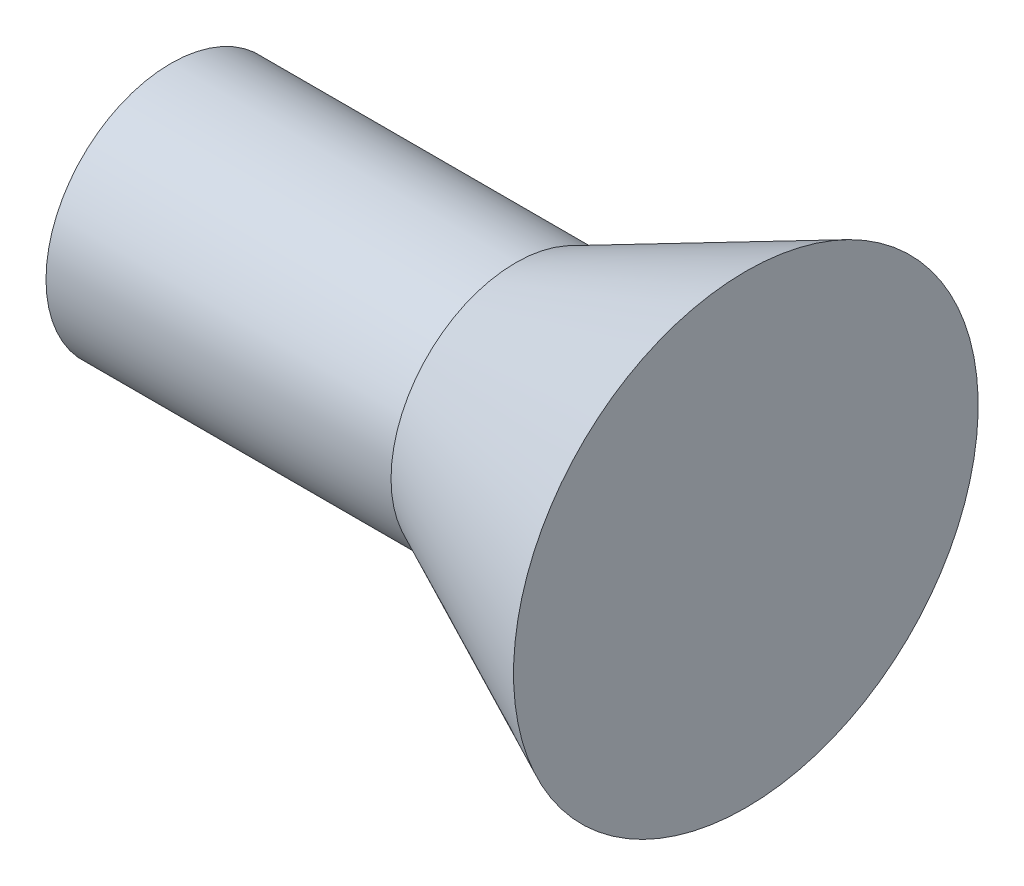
ISO-10303-21;
HEADER;
FILE_DESCRIPTION(('STEP AP214'),'2;1');
FILE_NAME('part.step','',(''),(''),'','','');
FILE_SCHEMA(('AUTOMOTIVE_DESIGN { 1 0 10303 214 1 1 1 1 }'));
ENDSEC;
DATA;
#1=APPLICATION_CONTEXT('core data for automotive mechanical design processes');
#2=APPLICATION_PROTOCOL_DEFINITION('international standard','automotive_design',2000,#1);
#3=PRODUCT_CONTEXT('',#1,'mechanical');
#4=PRODUCT('Part','Part','',(#3));
#5=PRODUCT_RELATED_PRODUCT_CATEGORY('part','',(#4));
#6=PRODUCT_DEFINITION_FORMATION('','',#4);
#7=PRODUCT_DEFINITION_CONTEXT('part definition',#1,'design');
#8=PRODUCT_DEFINITION('design','',#6,#7);
#9=PRODUCT_DEFINITION_SHAPE('','',#8);
#10=(LENGTH_UNIT() NAMED_UNIT(*) SI_UNIT(.MILLI.,.METRE.));
#11=(NAMED_UNIT(*) PLANE_ANGLE_UNIT() SI_UNIT($,.RADIAN.));
#12=(NAMED_UNIT(*) SI_UNIT($,.STERADIAN.) SOLID_ANGLE_UNIT());
#13=UNCERTAINTY_MEASURE_WITH_UNIT(LENGTH_MEASURE(1.E-05),#10,'distance_accuracy_value','');
#14=(GEOMETRIC_REPRESENTATION_CONTEXT(3) GLOBAL_UNCERTAINTY_ASSIGNED_CONTEXT((#13)) GLOBAL_UNIT_ASSIGNED_CONTEXT((#10,
#11,#12)) REPRESENTATION_CONTEXT('',''));
#15=CARTESIAN_POINT('',(0.,0.,0.));
#16=DIRECTION('',(0.,0.,1.));
#17=DIRECTION('',(1.,0.,0.));
#18=AXIS2_PLACEMENT_3D('',#15,#16,#17);
#19=CARTESIAN_POINT('',(0.,0.,0.));
#20=DIRECTION('',(-1.,0.,0.));
#21=DIRECTION('',(0.,-1.,0.));
#22=AXIS2_PLACEMENT_3D('',#19,#20,#21);
#23=PLANE('',#22);
#24=CARTESIAN_POINT('',(0.,0.,0.));
#25=DIRECTION('',(1.,0.,0.));
#26=DIRECTION('',(0.,1.,0.));
#27=AXIS2_PLACEMENT_3D('',#24,#25,#26);
#28=CIRCLE('',#27,5.425);
#29=CARTESIAN_POINT('',(0.,5.425,0.));
#30=VERTEX_POINT('',#29);
#31=EDGE_CURVE('E10',#30,#30,#28,.T.);
#32=ORIENTED_EDGE('',*,*,#31,.F.);
#33=EDGE_LOOP('',(#32));
#34=FACE_BOUND('',#33,.T.);
#35=ADVANCED_FACE('F41',(#34),#23,.T.);
#36=CARTESIAN_POINT('',(25.,0.,0.));
#37=DIRECTION('',(1.,0.,0.));
#38=DIRECTION('',(0.,1.,0.));
#39=AXIS2_PLACEMENT_3D('',#36,#37,#38);
#40=CYLINDRICAL_SURFACE('',#39,5.425);
#41=ORIENTED_EDGE('',*,*,#31,.T.);
#42=EDGE_LOOP('',(#41));
#43=FACE_BOUND('',#42,.T.);
#44=CARTESIAN_POINT('',(15.,0.,0.));
#45=DIRECTION('',(1.,0.,0.));
#46=DIRECTION('',(0.,1.,0.));
#47=AXIS2_PLACEMENT_3D('',#44,#45,#46);
#48=CIRCLE('',#47,5.425);
#49=CARTESIAN_POINT('',(15.,5.425,0.));
#50=VERTEX_POINT('',#49);
#51=EDGE_CURVE('E48',#50,#50,#48,.T.);
#52=ORIENTED_EDGE('',*,*,#51,.F.);
#53=EDGE_LOOP('',(#52));
#54=FACE_BOUND('',#53,.T.);
#55=ADVANCED_FACE('F65',(#43,#54),#40,.T.);
#56=CARTESIAN_POINT('',(25.,0.,0.));
#57=DIRECTION('',(1.,0.,0.));
#58=DIRECTION('',(0.,1.,0.));
#59=AXIS2_PLACEMENT_3D('',#56,#57,#58);
#60=CONICAL_SURFACE('',#59,10.1,0.437311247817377);
#61=ORIENTED_EDGE('',*,*,#51,.T.);
#62=EDGE_LOOP('',(#61));
#63=FACE_BOUND('',#62,.T.);
#64=CARTESIAN_POINT('',(25.,0.,0.));
#65=DIRECTION('',(1.,0.,0.));
#66=DIRECTION('',(0.,1.,0.));
#67=AXIS2_PLACEMENT_3D('',#64,#65,#66);
#68=CIRCLE('',#67,10.1);
#69=CARTESIAN_POINT('',(25.,10.1,0.));
#70=VERTEX_POINT('',#69);
#71=EDGE_CURVE('E53',#70,#70,#68,.T.);
#72=ORIENTED_EDGE('',*,*,#71,.F.);
#73=EDGE_LOOP('',(#72));
#74=FACE_BOUND('',#73,.T.);
#75=ADVANCED_FACE('F63',(#63,#74),#60,.T.);
#76=CARTESIAN_POINT('',(25.,10.1,0.));
#77=DIRECTION('',(1.,0.,0.));
#78=DIRECTION('',(0.,1.,0.));
#79=AXIS2_PLACEMENT_3D('',#76,#77,#78);
#80=PLANE('',#79);
#81=ORIENTED_EDGE('',*,*,#71,.T.);
#82=EDGE_LOOP('',(#81));
#83=FACE_BOUND('',#82,.T.);
#84=ADVANCED_FACE('F61',(#83),#80,.T.);
#85=CLOSED_SHELL('',(#35,#55,#75,#84));
#86=MANIFOLD_SOLID_BREP('B2',#85);
#87=ADVANCED_BREP_SHAPE_REPRESENTATION('',(#18,#86),#14);
#88=SHAPE_DEFINITION_REPRESENTATION(#9,#87);
ENDSEC;
END-ISO-10303-21;
